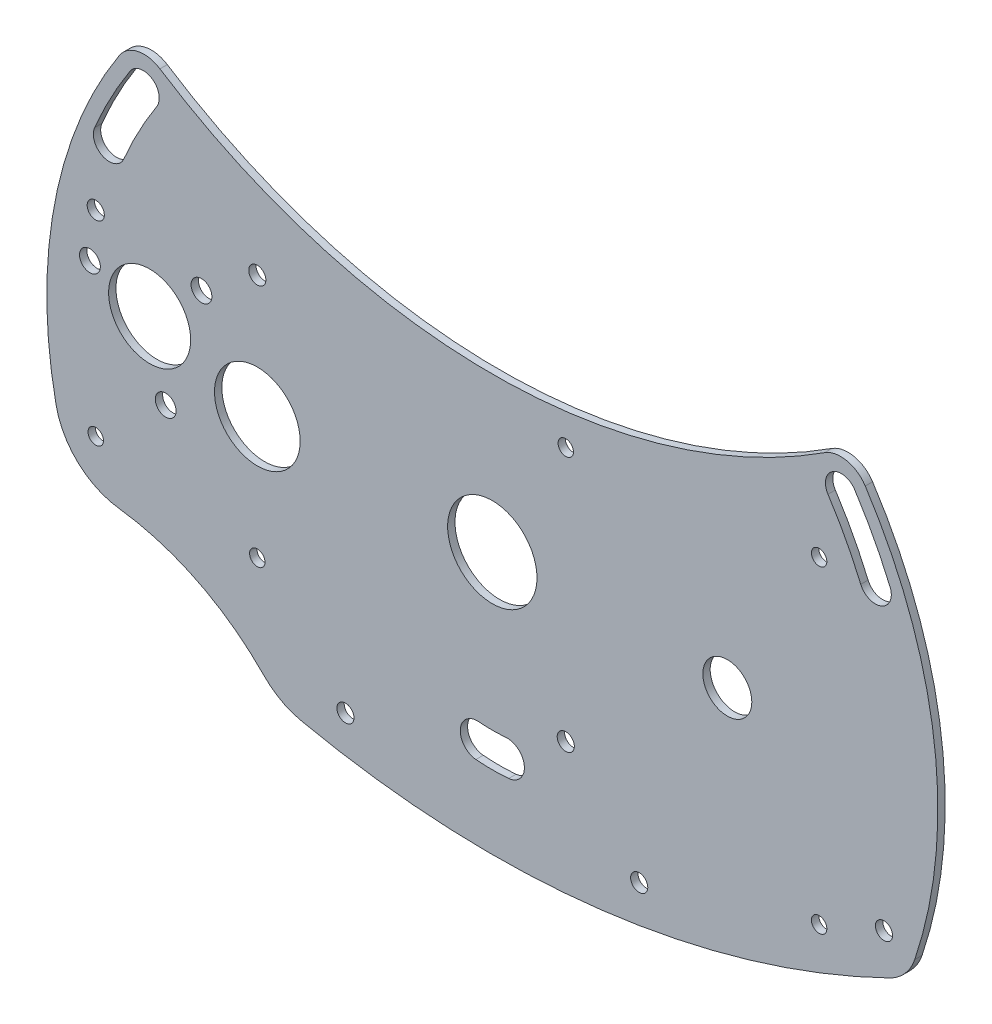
from build123d import *

# Parameters (mm, degrees)
ESQUISSE1_R                          = 18.25
ESQUISSE1_R_2                        = 10
ESQUISSE1_R_3                        = 17.5
ESQUISSE1_R_4                        = 16.75
ESQUISSE1_R_5                        = 4.25
SUPPORT_DEPTH                        = 3
ESQUISSE2_R                          = 3.15
ESQUISSE2_R_2                        = 3.5
FIXATION_BLOC_TRANS_DEPTH            = 458.747747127
LUMI_RE_R_GLAGE_DEPTH                = 458.747747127
ESQUISSE4_R                          = 3.5
FIXATION_PROTECTION_PROJECTION_DEPTH = 458.747747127


with BuildPart() as part:
    # Esquisse1 → support (new body)
    with BuildSketch(Plane.XY):
        with BuildLine():
            ThreePointArc((135.781202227, -209.912994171), (0, -250), (-135.781202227, -209.912994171))
            ThreePointArc((-135.781202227, -209.912994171), (-144.786819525, -208.249598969), (-152.343314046, -213.423322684))
            ThreePointArc((-152.343314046, -213.423322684), (-178.836391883, -279.213243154), (-178.171449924, -350.134006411))
            ThreePointArc((-178.171449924, -350.134006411), (-169.144341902, -366.06320166), (-152.54040739, -373.779243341))
            ThreePointArc((-152.54040739, -373.779243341), (-120.435726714, -383.478910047), (-93.343609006, -403.247855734))
            ThreePointArc((-93.343609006, -403.247855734), (-86.384309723, -408.56450013), (-78.186105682, -411.644760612))
            ThreePointArc((-78.186105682, -411.644760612), (44.550461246, -417.308121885), (162.374326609, -382.467409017))
            ThreePointArc((162.374326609, -382.467409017), (168.63365688, -377.68365592), (172.559970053, -370.853752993))
            ThreePointArc((172.559970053, -370.853752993), (180.517647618, -289.818565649), (152.343314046, -213.423322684))
            ThreePointArc((152.343314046, -213.423322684), (144.786819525, -208.249598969), (135.781202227, -209.912994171))
        make_face()
        with Locations((0, -313)):
            Circle(ESQUISSE1_R, mode=Mode.SUBTRACT)
        with Locations((96, -313)):
            Circle(ESQUISSE1_R_2, mode=Mode.SUBTRACT)
        with Locations((-96, -313)):
            Circle(ESQUISSE1_R_3, mode=Mode.SUBTRACT)
        with Locations((-139.990018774, -299.550901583)):
            Circle(ESQUISSE1_R_4, mode=Mode.SUBTRACT)
        with Locations((-164.375790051, -292.095423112)):
            Circle(ESQUISSE1_R_5, mode=Mode.SUBTRACT)
        with Locations((-118.814307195, -279.882672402)):
            Circle(ESQUISSE1_R_5, mode=Mode.SUBTRACT)
        with Locations((-133.432892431, -327.6979102)):
            Circle(ESQUISSE1_R_5, mode=Mode.SUBTRACT)
    extrude(amount=SUPPORT_DEPTH)

    # Esquisse2 → fixation bloc trans (cut, through all)
    with BuildSketch(Plane.XY.offset(3)):
        with Locations((30, -261)):
            Circle(ESQUISSE2_R)
        with Locations((30, -365)):
            Circle(ESQUISSE2_R_2)
        with Locations((133.5, -248.048094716)):
            Circle(ESQUISSE2_R)
        with Locations((133.5, -377.951905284)):
            Circle(ESQUISSE2_R)
        with Locations((-96, -263)):
            Circle(ESQUISSE2_R_2)
        with Locations((-96, -363)):
            Circle(ESQUISSE2_R)
        with Locations((-162, -273)):
            Circle(ESQUISSE2_R_2)
        with Locations((-162, -353)):
            Circle(ESQUISSE2_R)
    extrude(amount=-FIXATION_BLOC_TRANS_DEPTH, mode=Mode.SUBTRACT)

    # Esquisse3 → lumi_re r_glage (cut, through all)
    with BuildSketch(Plane.XY.offset(3)):
        with BuildLine():
            ThreePointArc((-150.502543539, -249.115460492), (-144.361931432, -236.241399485), (-137.122637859, -223.951517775))
            ThreePointArc((-137.122637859, -223.951517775), (-139.033842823, -214.960005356), (-148.025355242, -216.87121032))
            ThreePointArc((-148.025355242, -216.87121032), (-155.84025014, -230.138269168), (-162.469106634, -244.035955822))
            ThreePointArc((-162.469106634, -244.035955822), (-159.025577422, -252.558989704), (-150.502543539, -249.115460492))
        make_face()
        with BuildLine():
            ThreePointArc((162.469106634, -244.035955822), (159.025577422, -252.558989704), (150.502543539, -249.115460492))
            ThreePointArc((150.502543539, -249.115460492), (144.361931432, -236.241399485), (137.122637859, -223.951517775))
            ThreePointArc((137.122637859, -223.951517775), (139.033842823, -214.960005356), (148.025355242, -216.87121032))
            ThreePointArc((148.025355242, -216.87121032), (155.84025014, -230.138269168), (162.469106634, -244.035955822))
        make_face()
        with BuildLine():
            ThreePointArc((-5.490811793, -375.76026598), (0, -376), (5.490811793, -375.76026598))
            ThreePointArc((5.490811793, -375.76026598), (13.074264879, -382.123538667), (6.710992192, -389.706991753))
            ThreePointArc((6.710992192, -389.706991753), (0, -390), (-6.710992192, -389.706991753))
            ThreePointArc((-6.710992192, -389.706991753), (-13.074264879, -382.123538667), (-5.490811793, -375.76026598))
        make_face()
    extrude(amount=-LUMI_RE_R_GLAGE_DEPTH, mode=Mode.SUBTRACT)

    # Esquisse4 → fixation protection projection (cut, through all)
    with BuildSketch(Plane.XY.offset(3)):
        with Locations((160, -366.89903755)):
            Circle(ESQUISSE4_R)
        with Locations((60, -399.892840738)):
            Circle(ESQUISSE4_R)
        with Locations((-60, -399.892840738)):
            Circle(ESQUISSE4_R)
    extrude(amount=-FIXATION_PROTECTION_PROJECTION_DEPTH, mode=Mode.SUBTRACT)


solid = part.part
